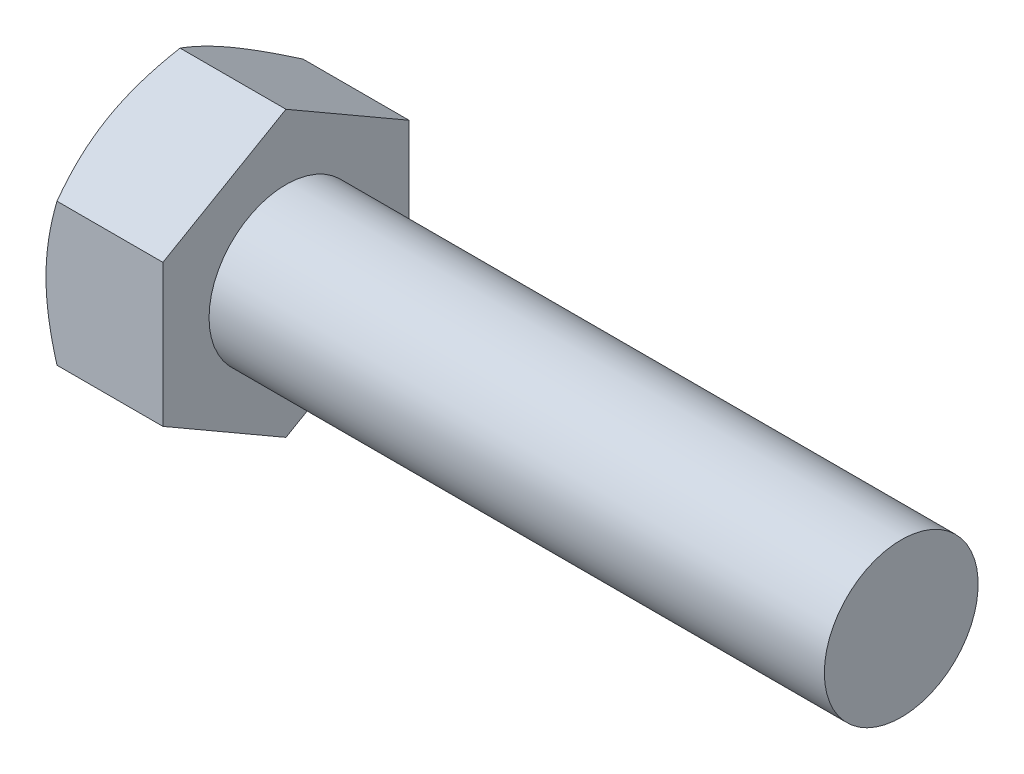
ISO-10303-21;
HEADER;
FILE_DESCRIPTION(('STEP AP214'),'2;1');
FILE_NAME('part.step','',(''),(''),'','','');
FILE_SCHEMA(('AUTOMOTIVE_DESIGN { 1 0 10303 214 1 1 1 1 }'));
ENDSEC;
DATA;
#1=APPLICATION_CONTEXT('core data for automotive mechanical design processes');
#2=APPLICATION_PROTOCOL_DEFINITION('international standard','automotive_design',2000,#1);
#3=PRODUCT_CONTEXT('',#1,'mechanical');
#4=PRODUCT('Part','Part','',(#3));
#5=PRODUCT_RELATED_PRODUCT_CATEGORY('part','',(#4));
#6=PRODUCT_DEFINITION_FORMATION('','',#4);
#7=PRODUCT_DEFINITION_CONTEXT('part definition',#1,'design');
#8=PRODUCT_DEFINITION('design','',#6,#7);
#9=PRODUCT_DEFINITION_SHAPE('','',#8);
#10=(LENGTH_UNIT() NAMED_UNIT(*) SI_UNIT(.MILLI.,.METRE.));
#11=(NAMED_UNIT(*) PLANE_ANGLE_UNIT() SI_UNIT($,.RADIAN.));
#12=(NAMED_UNIT(*) SI_UNIT($,.STERADIAN.) SOLID_ANGLE_UNIT());
#13=UNCERTAINTY_MEASURE_WITH_UNIT(LENGTH_MEASURE(1.E-05),#10,'distance_accuracy_value','');
#14=(GEOMETRIC_REPRESENTATION_CONTEXT(3) GLOBAL_UNCERTAINTY_ASSIGNED_CONTEXT((#13)) GLOBAL_UNIT_ASSIGNED_CONTEXT((#10,
#11,#12)) REPRESENTATION_CONTEXT('',''));
#15=CARTESIAN_POINT('',(0.,0.,0.));
#16=DIRECTION('',(0.,0.,1.));
#17=DIRECTION('',(1.,0.,0.));
#18=AXIS2_PLACEMENT_3D('',#15,#16,#17);
#19=CARTESIAN_POINT('',(3.8,2.5,0.));
#20=DIRECTION('',(-1.,0.,0.));
#21=DIRECTION('',(0.,0.,1.));
#22=AXIS2_PLACEMENT_3D('',#19,#20,#21);
#23=PLANE('',#22);
#24=CARTESIAN_POINT('',(3.8,0.,0.));
#25=DIRECTION('',(-1.,0.,0.));
#26=DIRECTION('',(0.,0.,1.));
#27=AXIS2_PLACEMENT_3D('',#24,#25,#26);
#28=CIRCLE('',#27,2.5);
#29=CARTESIAN_POINT('',(3.8,0.,2.5));
#30=VERTEX_POINT('',#29);
#31=EDGE_CURVE('E204',#30,#30,#28,.T.);
#32=ORIENTED_EDGE('',*,*,#31,.T.);
#33=EDGE_LOOP('',(#32));
#34=FACE_BOUND('',#33,.T.);
#35=DIRECTION('',(0.,1.,0.));
#36=VECTOR('',#35,1.);
#37=CARTESIAN_POINT('',(3.8,-2.30940108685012,4.));
#38=LINE('',#37,#36);
#39=CARTESIAN_POINT('',(3.8,-2.30940108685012,4.));
#40=VERTEX_POINT('',#39);
#41=CARTESIAN_POINT('',(3.8,2.30940108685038,4.));
#42=VERTEX_POINT('',#41);
#43=EDGE_CURVE('E64',#40,#42,#38,.T.);
#44=ORIENTED_EDGE('',*,*,#43,.F.);
#45=DIRECTION('',(0.,0.500000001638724,0.866025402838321));
#46=VECTOR('',#45,1.);
#47=CARTESIAN_POINT('',(3.8,-4.61880217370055,0.));
#48=LINE('',#47,#46);
#49=CARTESIAN_POINT('',(3.8,-4.61880217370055,0.));
#50=VERTEX_POINT('',#49);
#51=EDGE_CURVE('E137',#50,#40,#48,.T.);
#52=ORIENTED_EDGE('',*,*,#51,.F.);
#53=DIRECTION('',(0.,-0.500000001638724,0.866025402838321));
#54=VECTOR('',#53,1.);
#55=CARTESIAN_POINT('',(3.8,-2.30940108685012,-4.));
#56=LINE('',#55,#54);
#57=CARTESIAN_POINT('',(3.8,-2.30940108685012,-4.));
#58=VERTEX_POINT('',#57);
#59=EDGE_CURVE('E135',#58,#50,#56,.T.);
#60=ORIENTED_EDGE('',*,*,#59,.F.);
#61=DIRECTION('',(0.,-1.,0.));
#62=VECTOR('',#61,1.);
#63=CARTESIAN_POINT('',(3.8,2.30940108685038,-4.));
#64=LINE('',#63,#62);
#65=CARTESIAN_POINT('',(3.8,2.30940108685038,-4.));
#66=VERTEX_POINT('',#65);
#67=EDGE_CURVE('E118',#66,#58,#64,.T.);
#68=ORIENTED_EDGE('',*,*,#67,.F.);
#69=DIRECTION('',(0.,-0.500000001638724,-0.866025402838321));
#70=VECTOR('',#69,1.);
#71=CARTESIAN_POINT('',(3.8,4.61880217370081,0.));
#72=LINE('',#71,#70);
#73=CARTESIAN_POINT('',(3.8,4.61880217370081,0.));
#74=VERTEX_POINT('',#73);
#75=EDGE_CURVE('E127',#74,#66,#72,.T.);
#76=ORIENTED_EDGE('',*,*,#75,.F.);
#77=DIRECTION('',(0.,0.500000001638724,-0.866025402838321));
#78=VECTOR('',#77,1.);
#79=CARTESIAN_POINT('',(3.8,2.30940108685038,4.));
#80=LINE('',#79,#78);
#81=EDGE_CURVE('E131',#42,#74,#80,.T.);
#82=ORIENTED_EDGE('',*,*,#81,.F.);
#83=EDGE_LOOP('',(#44,#52,#60,#68,#76,#82));
#84=FACE_BOUND('',#83,.T.);
#85=ADVANCED_FACE('F41',(#34,#84),#23,.F.);
#86=CARTESIAN_POINT('',(-25.4,0.,0.));
#87=DIRECTION('',(-1.,0.,0.));
#88=DIRECTION('',(0.,0.,1.));
#89=AXIS2_PLACEMENT_3D('',#86,#87,#88);
#90=CYLINDRICAL_SURFACE('',#89,2.5);
#91=CARTESIAN_POINT('',(23.8,0.,0.));
#92=DIRECTION('',(-1.,0.,0.));
#93=DIRECTION('',(0.,0.,1.));
#94=AXIS2_PLACEMENT_3D('',#91,#92,#93);
#95=CIRCLE('',#94,2.5);
#96=CARTESIAN_POINT('',(23.8,0.,2.5));
#97=VERTEX_POINT('',#96);
#98=EDGE_CURVE('E11',#97,#97,#95,.T.);
#99=ORIENTED_EDGE('',*,*,#98,.T.);
#100=EDGE_LOOP('',(#99));
#101=FACE_BOUND('',#100,.T.);
#102=ORIENTED_EDGE('',*,*,#31,.F.);
#103=EDGE_LOOP('',(#102));
#104=FACE_BOUND('',#103,.T.);
#105=ADVANCED_FACE('F43',(#101,#104),#90,.T.);
#106=CARTESIAN_POINT('',(23.8,2.5,0.));
#107=DIRECTION('',(1.,0.,0.));
#108=DIRECTION('',(0.,0.,-1.));
#109=AXIS2_PLACEMENT_3D('',#106,#107,#108);
#110=PLANE('',#109);
#111=ORIENTED_EDGE('',*,*,#98,.F.);
#112=EDGE_LOOP('',(#111));
#113=FACE_BOUND('',#112,.T.);
#114=ADVANCED_FACE('F185',(#113),#110,.T.);
#115=CARTESIAN_POINT('',(3.8,-2.30940108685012,4.));
#116=DIRECTION('',(0.,0.,1.));
#117=DIRECTION('',(1.,0.,0.));
#118=AXIS2_PLACEMENT_3D('',#115,#116,#117);
#119=PLANE('',#118);
#120=DIRECTION('',(-1.,0.,0.));
#121=VECTOR('',#120,1.);
#122=CARTESIAN_POINT('',(3.8,-2.30940108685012,4.));
#123=LINE('',#122,#121);
#124=CARTESIAN_POINT('',(0.357265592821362,-2.30940108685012,4.));
#125=VERTEX_POINT('',#124);
#126=EDGE_CURVE('E144',#40,#125,#123,.T.);
#127=ORIENTED_EDGE('',*,*,#126,.F.);
#128=ORIENTED_EDGE('',*,*,#43,.T.);
#129=DIRECTION('',(-1.,0.,0.));
#130=VECTOR('',#129,1.);
#131=CARTESIAN_POINT('',(3.8,2.30940108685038,4.));
#132=LINE('',#131,#130);
#133=CARTESIAN_POINT('',(0.357265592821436,2.30940108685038,4.));
#134=VERTEX_POINT('',#133);
#135=EDGE_CURVE('E143',#42,#134,#132,.T.);
#136=ORIENTED_EDGE('',*,*,#135,.T.);
#137=CARTESIAN_POINT('',(1.91411207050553,-6.1248828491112,4.));
#138=CARTESIAN_POINT('',(1.82924143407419,-5.94926014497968,4.));
#139=CARTESIAN_POINT('',(1.74521447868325,-5.7732222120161,4.));
#140=CARTESIAN_POINT('',(1.57933003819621,-5.42009137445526,4.));
#141=CARTESIAN_POINT('',(1.49747292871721,-5.24299829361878,4.));
#142=CARTESIAN_POINT('',(1.33597906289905,-4.8865760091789,4.));
#143=CARTESIAN_POINT('',(1.25635769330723,-4.70723980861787,4.));
#144=CARTESIAN_POINT('',(1.10053486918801,-4.34709342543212,4.));
#145=CARTESIAN_POINT('',(1.02433323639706,-4.16628332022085,4.));
#146=CARTESIAN_POINT('',(0.875354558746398,-3.80065688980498,4.));
#147=CARTESIAN_POINT('',(0.802631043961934,-3.61581863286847,4.));
#148=CARTESIAN_POINT('',(0.662879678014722,-3.24396193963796,4.));
#149=CARTESIAN_POINT('',(0.595852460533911,-3.056943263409,4.));
#150=CARTESIAN_POINT('',(0.469294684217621,-2.680812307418,4.));
#151=CARTESIAN_POINT('',(0.409748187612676,-2.49170544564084,4.));
#152=CARTESIAN_POINT('',(0.300085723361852,-2.11080331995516,4.));
#153=CARTESIAN_POINT('',(0.249966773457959,-1.91900892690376,4.));
#154=CARTESIAN_POINT('',(0.161592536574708,-1.53260074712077,4.));
#155=CARTESIAN_POINT('',(0.12334040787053,-1.33798622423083,4.));
#156=CARTESIAN_POINT('',(0.0612753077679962,-0.9464107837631,4.));
#157=CARTESIAN_POINT('',(0.0374623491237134,-0.749449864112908,4.));
#158=CARTESIAN_POINT('',(0.00638220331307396,-0.35545965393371,4.));
#159=CARTESIAN_POINT('',(-0.000989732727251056,-0.158438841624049,4.));
#160=CARTESIAN_POINT('',(0.00120381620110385,0.235464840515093,4.));
#161=CARTESIAN_POINT('',(0.0107649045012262,0.432347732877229,4.));
#162=CARTESIAN_POINT('',(0.0408779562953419,0.768553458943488,4.));
#163=CARTESIAN_POINT('',(0.0575083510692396,0.908247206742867,4.));
#164=CARTESIAN_POINT('',(0.0982121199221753,1.18655561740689,4.));
#165=CARTESIAN_POINT('',(0.122286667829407,1.32517010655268,4.));
#166=CARTESIAN_POINT('',(0.204413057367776,1.73928168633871,4.));
#167=CARTESIAN_POINT('',(0.272346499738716,2.01283770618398,4.));
#168=CARTESIAN_POINT('',(0.389513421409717,2.42217270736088,4.));
#169=CARTESIAN_POINT('',(0.431710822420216,2.56008534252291,4.));
#170=CARTESIAN_POINT('',(0.520281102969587,2.8344711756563,4.));
#171=CARTESIAN_POINT('',(0.5666511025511,2.97094529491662,4.));
#172=CARTESIAN_POINT('',(0.66260169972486,3.2418834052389,4.));
#173=CARTESIAN_POINT('',(0.712162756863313,3.37635438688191,4.));
#174=CARTESIAN_POINT('',(0.814193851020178,3.64425303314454,4.));
#175=CARTESIAN_POINT('',(0.866665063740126,3.77768025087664,4.));
#176=CARTESIAN_POINT('',(0.920304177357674,3.91062502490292,4.));
#177=B_SPLINE_CURVE_WITH_KNOTS('',3,(#137,#138,#139,#140,#141,#142,#143,#144,#145,#146,#147,
#148,#149,#150,#151,#152,#153,#154,#155,#156,#157,#158,#159,#160,#161,#162,#163,#164,#165,#166,
#167,#168,#169,#170,#171,#172,#173,#174,#175,#176),.UNSPECIFIED.,.F.,.F.,(4,2,2,2,2,2,2,2,2,2,2,
2,2,2,2,2,2,2,2,4),(0.,0.585172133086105,1.17044491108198,1.75906694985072,2.34765826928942,
2.94347582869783,3.53935958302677,4.13395145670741,4.72835492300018,5.3229164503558,
5.91747850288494,6.50824153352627,7.09885119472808,7.52068574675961,7.94258684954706,
8.7870169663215,9.21965414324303,9.65199496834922,10.0819022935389,10.5119845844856),.UNSPECIFIED.);
#178=CARTESIAN_POINT('',(0.,0.,4.));
#179=VERTEX_POINT('',#178);
#180=EDGE_CURVE('E187',#179,#134,#177,.T.);
#181=ORIENTED_EDGE('',*,*,#180,.F.);
#182=EDGE_CURVE('E195',#125,#179,#177,.T.);
#183=ORIENTED_EDGE('',*,*,#182,.F.);
#184=EDGE_LOOP('',(#127,#128,#136,#181,#183));
#185=FACE_BOUND('',#184,.T.);
#186=ADVANCED_FACE('F181',(#185),#119,.T.);
#187=CARTESIAN_POINT('',(3.8,-4.61880217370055,0.));
#188=DIRECTION('',(0.,-0.866025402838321,0.500000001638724));
#189=DIRECTION('',(0.,-0.500000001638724,-0.866025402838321));
#190=AXIS2_PLACEMENT_3D('',#187,#188,#189);
#191=PLANE('',#190);
#192=DIRECTION('',(-1.,0.,0.));
#193=VECTOR('',#192,1.);
#194=CARTESIAN_POINT('',(3.8,-4.61880217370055,0.));
#195=LINE('',#194,#193);
#196=CARTESIAN_POINT('',(0.357265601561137,-4.61880217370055,0.));
#197=VERTEX_POINT('',#196);
#198=EDGE_CURVE('E148',#50,#197,#195,.T.);
#199=ORIENTED_EDGE('',*,*,#198,.F.);
#200=ORIENTED_EDGE('',*,*,#51,.T.);
#201=ORIENTED_EDGE('',*,*,#126,.T.);
#202=CARTESIAN_POINT('',(0.357332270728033,-4.61891764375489,-0.000200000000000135));
#203=CARTESIAN_POINT('',(0.298717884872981,-4.51743150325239,0.175579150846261));
#204=CARTESIAN_POINT('',(0.245410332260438,-4.41506934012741,0.352875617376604));
#205=CARTESIAN_POINT('',(0.152361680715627,-4.20857252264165,0.710538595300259));
#206=CARTESIAN_POINT('',(0.112653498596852,-4.1044341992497,0.890911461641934));
#207=CARTESIAN_POINT('',(0.0508422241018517,-3.89744814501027,1.24942182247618));
#208=CARTESIAN_POINT('',(0.0283277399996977,-3.79463226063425,1.42750415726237));
#209=CARTESIAN_POINT('',(0.00145063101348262,-3.58851673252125,1.78450672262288));
#210=CARTESIAN_POINT('',(-0.0029342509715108,-3.48521783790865,1.96342565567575));
#211=CARTESIAN_POINT('',(0.00619008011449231,-3.29219971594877,2.29774284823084));
#212=CARTESIAN_POINT('',(0.0174589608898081,-3.2024515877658,2.45319116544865));
#213=CARTESIAN_POINT('',(0.0531739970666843,-3.02354003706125,2.76307505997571));
#214=CARTESIAN_POINT('',(0.077632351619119,-2.93437723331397,2.91750956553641));
#215=CARTESIAN_POINT('',(0.138776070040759,-2.75509683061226,3.22803233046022));
#216=CARTESIAN_POINT('',(0.175720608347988,-2.66500192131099,3.38408129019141));
#217=CARTESIAN_POINT('',(0.25957007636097,-2.48615581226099,3.69385183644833));
#218=CARTESIAN_POINT('',(0.306455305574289,-2.39740232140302,3.84757739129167));
#219=CARTESIAN_POINT('',(0.357332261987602,-2.30928561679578,4.0002));
#220=B_SPLINE_CURVE_WITH_KNOTS('',3,(#202,#203,#204,#205,#206,#207,#208,#209,#210,#211,#212,
#213,#214,#215,#216,#217,#218,#219),.UNSPECIFIED.,.F.,.F.,(4,2,2,2,2,2,2,2,4),(0.,
0.634047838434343,1.26961969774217,1.88946158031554,2.5085422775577,3.04757826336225,
3.58711366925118,4.13861653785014,4.68903648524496),.UNSPECIFIED.);
#221=CARTESIAN_POINT('',(0.,-3.46410162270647,2.00000001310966));
#222=VERTEX_POINT('',#221);
#223=EDGE_CURVE('E197',#222,#125,#220,.T.);
#224=ORIENTED_EDGE('',*,*,#223,.F.);
#225=EDGE_CURVE('E196',#197,#222,#220,.T.);
#226=ORIENTED_EDGE('',*,*,#225,.F.);
#227=EDGE_LOOP('',(#199,#200,#201,#224,#226));
#228=FACE_BOUND('',#227,.T.);
#229=ADVANCED_FACE('F184',(#228),#191,.T.);
#230=CARTESIAN_POINT('',(3.8,-2.30940108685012,-4.));
#231=DIRECTION('',(0.,-0.866025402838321,-0.500000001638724));
#232=DIRECTION('',(0.,0.500000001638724,-0.866025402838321));
#233=AXIS2_PLACEMENT_3D('',#230,#231,#232);
#234=PLANE('',#233);
#235=DIRECTION('',(-1.,0.,0.));
#236=VECTOR('',#235,1.);
#237=CARTESIAN_POINT('',(3.8,-2.30940108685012,-4.));
#238=LINE('',#237,#236);
#239=CARTESIAN_POINT('',(0.357265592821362,-2.30940108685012,-4.));
#240=VERTEX_POINT('',#239);
#241=EDGE_CURVE('E124',#58,#240,#238,.T.);
#242=ORIENTED_EDGE('',*,*,#241,.F.);
#243=ORIENTED_EDGE('',*,*,#59,.T.);
#244=ORIENTED_EDGE('',*,*,#198,.T.);
#245=CARTESIAN_POINT('',(0.357332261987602,-2.30928561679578,-4.0002));
#246=CARTESIAN_POINT('',(0.29871787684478,-2.41077175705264,-3.8244208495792));
#247=CARTESIAN_POINT('',(0.245410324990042,-2.51313391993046,-3.64712438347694));
#248=CARTESIAN_POINT('',(0.152361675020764,-2.7196307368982,-3.28946140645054));
#249=CARTESIAN_POINT('',(0.112653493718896,-2.82376906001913,-3.10908854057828));
#250=CARTESIAN_POINT('',(0.0508422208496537,-3.03075511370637,-2.75057818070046));
#251=CARTESIAN_POINT('',(0.0283277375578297,-3.13357099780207,-2.5724958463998));
#252=CARTESIAN_POINT('',(0.00145063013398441,-3.3396865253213,-2.21549328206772));
#253=CARTESIAN_POINT('',(-0.00293425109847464,-3.44298541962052,-2.03657434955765));
#254=CARTESIAN_POINT('',(0.0061900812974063,-3.6360035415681,-1.70225715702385));
#255=CARTESIAN_POINT('',(0.0174589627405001,-3.72575167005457,-1.54680883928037));
#256=CARTESIAN_POINT('',(0.053174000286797,-3.90466322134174,-1.23692494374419));
#257=CARTESIAN_POINT('',(0.0776323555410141,-3.9938260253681,-1.08249043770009));
#258=CARTESIAN_POINT('',(0.138776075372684,-4.17310642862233,-0.771967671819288));
#259=CARTESIAN_POINT('',(0.175720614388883,-4.26320133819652,-0.615918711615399));
#260=CARTESIAN_POINT('',(0.259570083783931,-4.44204744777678,-0.30614816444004));
#261=CARTESIAN_POINT('',(0.306455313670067,-4.53080093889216,-0.152422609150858));
#262=CARTESIAN_POINT('',(0.357332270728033,-4.61891764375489,0.000200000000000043));
#263=B_SPLINE_CURVE_WITH_KNOTS('',3,(#245,#246,#247,#248,#249,#250,#251,#252,#253,#254,#255,
#256,#257,#258,#259,#260,#261,#262),.UNSPECIFIED.,.F.,.F.,(4,2,2,2,2,2,2,2,4),(0.,
0.634047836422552,1.26961969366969,1.88946157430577,2.50854226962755,3.04757825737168,
3.58711366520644,4.13861653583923,4.68903648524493),.UNSPECIFIED.);
#264=CARTESIAN_POINT('',(0.,-3.46410162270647,-2.00000001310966));
#265=VERTEX_POINT('',#264);
#266=EDGE_CURVE('E227',#265,#197,#263,.T.);
#267=ORIENTED_EDGE('',*,*,#266,.F.);
#268=EDGE_CURVE('E232',#240,#265,#263,.T.);
#269=ORIENTED_EDGE('',*,*,#268,.F.);
#270=EDGE_LOOP('',(#242,#243,#244,#267,#269));
#271=FACE_BOUND('',#270,.T.);
#272=ADVANCED_FACE('F303',(#271),#234,.T.);
#273=CARTESIAN_POINT('',(3.8,2.30940108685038,-4.));
#274=DIRECTION('',(0.,0.,-1.));
#275=DIRECTION('',(-1.,0.,0.));
#276=AXIS2_PLACEMENT_3D('',#273,#274,#275);
#277=PLANE('',#276);
#278=DIRECTION('',(-1.,0.,0.));
#279=VECTOR('',#278,1.);
#280=CARTESIAN_POINT('',(3.8,2.30940108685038,-4.));
#281=LINE('',#280,#279);
#282=CARTESIAN_POINT('',(0.357265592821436,2.30940108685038,-4.));
#283=VERTEX_POINT('',#282);
#284=EDGE_CURVE('E113',#66,#283,#281,.T.);
#285=ORIENTED_EDGE('',*,*,#284,.F.);
#286=ORIENTED_EDGE('',*,*,#67,.T.);
#287=ORIENTED_EDGE('',*,*,#241,.T.);
#288=CARTESIAN_POINT('',(1.91411207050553,-6.1248828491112,-4.));
#289=CARTESIAN_POINT('',(1.82924143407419,-5.94926014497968,-4.));
#290=CARTESIAN_POINT('',(1.74521447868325,-5.7732222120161,-4.));
#291=CARTESIAN_POINT('',(1.57933003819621,-5.42009137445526,-4.));
#292=CARTESIAN_POINT('',(1.49747292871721,-5.24299829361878,-4.));
#293=CARTESIAN_POINT('',(1.33597906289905,-4.8865760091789,-4.));
#294=CARTESIAN_POINT('',(1.25635769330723,-4.70723980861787,-4.));
#295=CARTESIAN_POINT('',(1.10053486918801,-4.34709342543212,-4.));
#296=CARTESIAN_POINT('',(1.02433323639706,-4.16628332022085,-4.));
#297=CARTESIAN_POINT('',(0.875354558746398,-3.80065688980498,-4.));
#298=CARTESIAN_POINT('',(0.802631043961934,-3.61581863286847,-4.));
#299=CARTESIAN_POINT('',(0.662879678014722,-3.24396193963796,-4.));
#300=CARTESIAN_POINT('',(0.595852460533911,-3.056943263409,-4.));
#301=CARTESIAN_POINT('',(0.469294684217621,-2.680812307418,-4.));
#302=CARTESIAN_POINT('',(0.409748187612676,-2.49170544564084,-4.));
#303=CARTESIAN_POINT('',(0.300085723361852,-2.11080331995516,-4.));
#304=CARTESIAN_POINT('',(0.249966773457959,-1.91900892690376,-4.));
#305=CARTESIAN_POINT('',(0.161592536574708,-1.53260074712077,-4.));
#306=CARTESIAN_POINT('',(0.12334040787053,-1.33798622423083,-4.));
#307=CARTESIAN_POINT('',(0.0612753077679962,-0.9464107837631,-4.));
#308=CARTESIAN_POINT('',(0.0374623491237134,-0.749449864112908,-4.));
#309=CARTESIAN_POINT('',(0.00638220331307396,-0.35545965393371,-4.));
#310=CARTESIAN_POINT('',(-0.000989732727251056,-0.158438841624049,-4.));
#311=CARTESIAN_POINT('',(0.00120381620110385,0.235464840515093,-4.));
#312=CARTESIAN_POINT('',(0.0107649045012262,0.432347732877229,-4.));
#313=CARTESIAN_POINT('',(0.0408779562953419,0.768553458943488,-4.));
#314=CARTESIAN_POINT('',(0.0575083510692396,0.908247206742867,-4.));
#315=CARTESIAN_POINT('',(0.0982121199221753,1.18655561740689,-4.));
#316=CARTESIAN_POINT('',(0.122286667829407,1.32517010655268,-4.));
#317=CARTESIAN_POINT('',(0.204413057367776,1.73928168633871,-4.));
#318=CARTESIAN_POINT('',(0.272346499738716,2.01283770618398,-4.));
#319=CARTESIAN_POINT('',(0.389513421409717,2.42217270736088,-4.));
#320=CARTESIAN_POINT('',(0.431710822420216,2.56008534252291,-4.));
#321=CARTESIAN_POINT('',(0.520281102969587,2.8344711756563,-4.));
#322=CARTESIAN_POINT('',(0.5666511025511,2.97094529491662,-4.));
#323=CARTESIAN_POINT('',(0.66260169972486,3.2418834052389,-4.));
#324=CARTESIAN_POINT('',(0.712162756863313,3.37635438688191,-4.));
#325=CARTESIAN_POINT('',(0.814193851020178,3.64425303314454,-4.));
#326=CARTESIAN_POINT('',(0.866665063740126,3.77768025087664,-4.));
#327=CARTESIAN_POINT('',(0.920304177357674,3.91062502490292,-4.));
#328=B_SPLINE_CURVE_WITH_KNOTS('',3,(#288,#289,#290,#291,#292,#293,#294,#295,#296,#297,#298,
#299,#300,#301,#302,#303,#304,#305,#306,#307,#308,#309,#310,#311,#312,#313,#314,#315,#316,#317,
#318,#319,#320,#321,#322,#323,#324,#325,#326,#327),.UNSPECIFIED.,.F.,.F.,(4,2,2,2,2,2,2,2,2,2,2,
2,2,2,2,2,2,2,2,4),(0.,0.585172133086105,1.17044491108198,1.75906694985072,2.34765826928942,
2.94347582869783,3.53935958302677,4.13395145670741,4.72835492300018,5.3229164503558,
5.91747850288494,6.50824153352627,7.09885119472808,7.52068574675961,7.94258684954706,
8.7870169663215,9.21965414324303,9.65199496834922,10.0819022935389,10.5119845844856),.UNSPECIFIED.);
#329=CARTESIAN_POINT('',(0.,0.,-4.));
#330=VERTEX_POINT('',#329);
#331=EDGE_CURVE('E228',#330,#240,#328,.F.);
#332=ORIENTED_EDGE('',*,*,#331,.F.);
#333=EDGE_CURVE('E121',#283,#330,#328,.F.);
#334=ORIENTED_EDGE('',*,*,#333,.F.);
#335=EDGE_LOOP('',(#285,#286,#287,#332,#334));
#336=FACE_BOUND('',#335,.T.);
#337=ADVANCED_FACE('F115',(#336),#277,.T.);
#338=CARTESIAN_POINT('',(3.8,4.61880217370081,0.));
#339=DIRECTION('',(0.,0.866025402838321,-0.500000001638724));
#340=DIRECTION('',(0.,0.500000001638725,0.866025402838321));
#341=AXIS2_PLACEMENT_3D('',#338,#339,#340);
#342=PLANE('',#341);
#343=DIRECTION('',(-1.,0.,0.));
#344=VECTOR('',#343,1.);
#345=CARTESIAN_POINT('',(3.8,4.61880217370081,0.));
#346=LINE('',#345,#344);
#347=CARTESIAN_POINT('',(0.357265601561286,4.61880217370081,0.));
#348=VERTEX_POINT('',#347);
#349=EDGE_CURVE('E56',#74,#348,#346,.T.);
#350=ORIENTED_EDGE('',*,*,#349,.F.);
#351=ORIENTED_EDGE('',*,*,#75,.T.);
#352=ORIENTED_EDGE('',*,*,#284,.T.);
#353=CARTESIAN_POINT('',(0.357332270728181,4.61891764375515,0.000200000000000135));
#354=CARTESIAN_POINT('',(0.298717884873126,4.51743150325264,-0.175579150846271));
#355=CARTESIAN_POINT('',(0.24541033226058,4.41506934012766,-0.352875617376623));
#356=CARTESIAN_POINT('',(0.152361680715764,4.20857252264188,-0.710538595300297));
#357=CARTESIAN_POINT('',(0.112653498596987,4.10443419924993,-0.890911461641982));
#358=CARTESIAN_POINT('',(0.0508422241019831,3.89744814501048,-1.24942182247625));
#359=CARTESIAN_POINT('',(0.0283277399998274,3.79463226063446,-1.42750415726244));
#360=CARTESIAN_POINT('',(0.00145063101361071,3.58851673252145,-1.78450672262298));
#361=CARTESIAN_POINT('',(-0.00293425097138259,3.48521783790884,-1.96342565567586));
#362=CARTESIAN_POINT('',(0.0061900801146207,3.29219971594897,-2.29774284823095));
#363=CARTESIAN_POINT('',(0.0174589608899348,3.202451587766,-2.45319116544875));
#364=CARTESIAN_POINT('',(0.0531739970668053,3.02354003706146,-2.76307505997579));
#365=CARTESIAN_POINT('',(0.0776323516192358,2.93437723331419,-2.91750956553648));
#366=CARTESIAN_POINT('',(0.138776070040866,2.75509683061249,-3.22803233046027));
#367=CARTESIAN_POINT('',(0.175720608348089,2.66500192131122,-3.38408129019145));
#368=CARTESIAN_POINT('',(0.259570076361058,2.48615581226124,-3.69385183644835));
#369=CARTESIAN_POINT('',(0.306455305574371,2.39740232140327,-3.84757739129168));
#370=CARTESIAN_POINT('',(0.357332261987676,2.30928561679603,-4.0002));
#371=B_SPLINE_CURVE_WITH_KNOTS('',3,(#353,#354,#355,#356,#357,#358,#359,#360,#361,#362,#363,
#364,#365,#366,#367,#368,#369,#370),.UNSPECIFIED.,.F.,.F.,(4,2,2,2,2,2,2,2,4),(0.,
0.634047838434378,1.26961969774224,1.88946158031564,2.50854227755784,3.04757826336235,
3.58711366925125,4.13861653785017,4.68903648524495),.UNSPECIFIED.);
#372=CARTESIAN_POINT('',(0.,3.46410162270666,-2.00000001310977));
#373=VERTEX_POINT('',#372);
#374=EDGE_CURVE('E163',#373,#283,#371,.T.);
#375=ORIENTED_EDGE('',*,*,#374,.F.);
#376=EDGE_CURVE('E291',#348,#373,#371,.T.);
#377=ORIENTED_EDGE('',*,*,#376,.F.);
#378=EDGE_LOOP('',(#350,#351,#352,#375,#377));
#379=FACE_BOUND('',#378,.T.);
#380=ADVANCED_FACE('F128',(#379),#342,.T.);
#381=CARTESIAN_POINT('',(3.8,2.30940108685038,4.));
#382=DIRECTION('',(0.,0.866025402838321,0.500000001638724));
#383=DIRECTION('',(0.,-0.500000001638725,0.866025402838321));
#384=AXIS2_PLACEMENT_3D('',#381,#382,#383);
#385=PLANE('',#384);
#386=ORIENTED_EDGE('',*,*,#135,.F.);
#387=ORIENTED_EDGE('',*,*,#81,.T.);
#388=ORIENTED_EDGE('',*,*,#349,.T.);
#389=CARTESIAN_POINT('',(0.357332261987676,2.30928561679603,4.0002));
#390=CARTESIAN_POINT('',(0.298717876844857,2.4107717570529,3.82442084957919));
#391=CARTESIAN_POINT('',(0.245410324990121,2.51313391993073,3.64712438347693));
#392=CARTESIAN_POINT('',(0.152361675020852,2.71963073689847,3.28946140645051));
#393=CARTESIAN_POINT('',(0.11265349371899,2.8237690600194,3.10908854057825));
#394=CARTESIAN_POINT('',(0.0508422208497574,3.03075511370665,2.75057818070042));
#395=CARTESIAN_POINT('',(0.0283277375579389,3.13357099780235,2.57249584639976));
#396=CARTESIAN_POINT('',(0.00145063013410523,3.33968652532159,2.21549328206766));
#397=CARTESIAN_POINT('',(-0.00293425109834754,3.44298541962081,2.03657434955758));
#398=CARTESIAN_POINT('',(0.00619008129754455,3.63600354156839,1.70225715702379));
#399=CARTESIAN_POINT('',(0.0174589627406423,3.72575167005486,1.54680883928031));
#400=CARTESIAN_POINT('',(0.0531740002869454,3.90466322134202,1.23692494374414));
#401=CARTESIAN_POINT('',(0.0776323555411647,3.99382602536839,1.08249043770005));
#402=CARTESIAN_POINT('',(0.138776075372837,4.17310642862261,0.771967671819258));
#403=CARTESIAN_POINT('',(0.175720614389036,4.26320133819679,0.615918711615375));
#404=CARTESIAN_POINT('',(0.259570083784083,4.44204744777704,0.306148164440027));
#405=CARTESIAN_POINT('',(0.306455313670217,4.53080093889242,0.152422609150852));
#406=CARTESIAN_POINT('',(0.357332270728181,4.61891764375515,-0.000200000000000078));
#407=B_SPLINE_CURVE_WITH_KNOTS('',3,(#389,#390,#391,#392,#393,#394,#395,#396,#397,#398,#399,
#400,#401,#402,#403,#404,#405,#406),.UNSPECIFIED.,.F.,.F.,(4,2,2,2,2,2,2,2,4),(0.,
0.63404783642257,1.26961969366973,1.88946157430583,2.50854226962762,3.04757825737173,
3.58711366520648,4.13861653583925,4.68903648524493),.UNSPECIFIED.);
#408=CARTESIAN_POINT('',(0.,3.46410162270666,2.00000001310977));
#409=VERTEX_POINT('',#408);
#410=EDGE_CURVE('E147',#409,#348,#407,.T.);
#411=ORIENTED_EDGE('',*,*,#410,.F.);
#412=EDGE_CURVE('E162',#134,#409,#407,.T.);
#413=ORIENTED_EDGE('',*,*,#412,.F.);
#414=EDGE_LOOP('',(#386,#387,#388,#411,#413));
#415=FACE_BOUND('',#414,.T.);
#416=ADVANCED_FACE('F174',(#415),#385,.T.);
#417=CARTESIAN_POINT('',(0.,0.,0.));
#418=DIRECTION('',(1.,0.,0.));
#419=DIRECTION('',(0.,0.,-1.));
#420=AXIS2_PLACEMENT_3D('',#417,#418,#419);
#421=CONICAL_SURFACE('',#420,4.,1.0471975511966);
#422=CARTESIAN_POINT('',(0.,0.,0.));
#423=DIRECTION('',(-1.,0.,0.));
#424=DIRECTION('',(0.,0.,1.));
#425=AXIS2_PLACEMENT_3D('',#422,#423,#424);
#426=CIRCLE('',#425,4.);
#427=EDGE_CURVE('E206',#222,#179,#426,.T.);
#428=ORIENTED_EDGE('',*,*,#427,.F.);
#429=ORIENTED_EDGE('',*,*,#223,.T.);
#430=ORIENTED_EDGE('',*,*,#182,.T.);
#431=EDGE_LOOP('',(#428,#429,#430));
#432=FACE_BOUND('',#431,.T.);
#433=ADVANCED_FACE('F178',(#432),#421,.T.);
#434=EDGE_CURVE('E214',#265,#222,#426,.T.);
#435=ORIENTED_EDGE('',*,*,#434,.F.);
#436=ORIENTED_EDGE('',*,*,#266,.T.);
#437=ORIENTED_EDGE('',*,*,#225,.T.);
#438=EDGE_LOOP('',(#435,#436,#437));
#439=FACE_BOUND('',#438,.T.);
#440=ADVANCED_FACE('F237',(#439),#421,.T.);
#441=ORIENTED_EDGE('',*,*,#331,.T.);
#442=ORIENTED_EDGE('',*,*,#268,.T.);
#443=EDGE_CURVE('E217',#330,#265,#426,.T.);
#444=ORIENTED_EDGE('',*,*,#443,.F.);
#445=EDGE_LOOP('',(#441,#442,#444));
#446=FACE_BOUND('',#445,.T.);
#447=ADVANCED_FACE('F170',(#446),#421,.T.);
#448=ORIENTED_EDGE('',*,*,#374,.T.);
#449=ORIENTED_EDGE('',*,*,#333,.T.);
#450=EDGE_CURVE('E213',#373,#330,#426,.T.);
#451=ORIENTED_EDGE('',*,*,#450,.F.);
#452=EDGE_LOOP('',(#448,#449,#451));
#453=FACE_BOUND('',#452,.T.);
#454=ADVANCED_FACE('F226',(#453),#421,.T.);
#455=EDGE_CURVE('E49',#179,#409,#426,.T.);
#456=ORIENTED_EDGE('',*,*,#455,.F.);
#457=ORIENTED_EDGE('',*,*,#180,.T.);
#458=ORIENTED_EDGE('',*,*,#412,.T.);
#459=EDGE_LOOP('',(#456,#457,#458));
#460=FACE_BOUND('',#459,.T.);
#461=ADVANCED_FACE('F266',(#460),#421,.T.);
#462=CARTESIAN_POINT('',(0.,0.,0.));
#463=DIRECTION('',(-1.,0.,0.));
#464=DIRECTION('',(0.,0.,1.));
#465=AXIS2_PLACEMENT_3D('',#462,#463,#464);
#466=PLANE('',#465);
#467=CARTESIAN_POINT('',(0.,0.,0.));
#468=DIRECTION('',(1.,0.,0.));
#469=DIRECTION('',(0.,0.,-1.));
#470=AXIS2_PLACEMENT_3D('',#467,#468,#469);
#471=CIRCLE('',#470,3.5);
#472=CARTESIAN_POINT('',(0.,0.,3.5));
#473=VERTEX_POINT('',#472);
#474=EDGE_CURVE('E245',#473,#473,#471,.T.);
#475=ORIENTED_EDGE('',*,*,#474,.T.);
#476=EDGE_LOOP('',(#475));
#477=FACE_BOUND('',#476,.T.);
#478=ORIENTED_EDGE('',*,*,#455,.T.);
#479=EDGE_CURVE('E208',#409,#373,#426,.T.);
#480=ORIENTED_EDGE('',*,*,#479,.T.);
#481=ORIENTED_EDGE('',*,*,#450,.T.);
#482=ORIENTED_EDGE('',*,*,#443,.T.);
#483=ORIENTED_EDGE('',*,*,#434,.T.);
#484=ORIENTED_EDGE('',*,*,#427,.T.);
#485=EDGE_LOOP('',(#478,#480,#481,#482,#483,#484));
#486=FACE_BOUND('',#485,.T.);
#487=ADVANCED_FACE('F223',(#477,#486),#466,.T.);
#488=ORIENTED_EDGE('',*,*,#410,.T.);
#489=ORIENTED_EDGE('',*,*,#376,.T.);
#490=ORIENTED_EDGE('',*,*,#479,.F.);
#491=EDGE_LOOP('',(#488,#489,#490));
#492=FACE_BOUND('',#491,.T.);
#493=ADVANCED_FACE('F255',(#492),#421,.T.);
#494=CARTESIAN_POINT('',(0.475,0.,0.));
#495=DIRECTION('',(-1.,0.,0.));
#496=DIRECTION('',(0.,0.,1.));
#497=AXIS2_PLACEMENT_3D('',#494,#495,#496);
#498=CYLINDRICAL_SURFACE('',#497,3.5);
#499=CARTESIAN_POINT('',(0.475,0.,0.));
#500=DIRECTION('',(1.,0.,0.));
#501=DIRECTION('',(0.,0.,-1.));
#502=AXIS2_PLACEMENT_3D('',#499,#500,#501);
#503=CIRCLE('',#502,3.5);
#504=CARTESIAN_POINT('',(0.475,0.,3.5));
#505=VERTEX_POINT('',#504);
#506=EDGE_CURVE('E242',#505,#505,#503,.T.);
#507=CARTESIAN_POINT('',(0.475,0.,3.5));
#508=CARTESIAN_POINT('',(0.470052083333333,0.,3.5));
#509=CARTESIAN_POINT('',(0.465104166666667,0.,3.5));
#510=CARTESIAN_POINT('',(0.455208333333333,0.,3.5));
#511=CARTESIAN_POINT('',(0.450260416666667,0.,3.5));
#512=CARTESIAN_POINT('',(0.440364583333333,0.,3.5));
#513=CARTESIAN_POINT('',(0.435416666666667,0.,3.5));
#514=CARTESIAN_POINT('',(0.425520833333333,0.,3.5));
#515=CARTESIAN_POINT('',(0.420572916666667,0.,3.5));
#516=CARTESIAN_POINT('',(0.410677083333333,0.,3.5));
#517=CARTESIAN_POINT('',(0.405729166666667,0.,3.5));
#518=CARTESIAN_POINT('',(0.395833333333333,0.,3.5));
#519=CARTESIAN_POINT('',(0.390885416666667,0.,3.5));
#520=CARTESIAN_POINT('',(0.380989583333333,0.,3.5));
#521=CARTESIAN_POINT('',(0.376041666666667,0.,3.5));
#522=CARTESIAN_POINT('',(0.366145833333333,0.,3.5));
#523=CARTESIAN_POINT('',(0.361197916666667,0.,3.5));
#524=CARTESIAN_POINT('',(0.351302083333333,0.,3.5));
#525=CARTESIAN_POINT('',(0.346354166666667,0.,3.5));
#526=CARTESIAN_POINT('',(0.336458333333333,0.,3.5));
#527=CARTESIAN_POINT('',(0.331510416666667,0.,3.5));
#528=CARTESIAN_POINT('',(0.321614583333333,0.,3.5));
#529=CARTESIAN_POINT('',(0.316666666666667,0.,3.5));
#530=CARTESIAN_POINT('',(0.306770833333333,0.,3.5));
#531=CARTESIAN_POINT('',(0.301822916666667,0.,3.5));
#532=CARTESIAN_POINT('',(0.291927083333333,0.,3.5));
#533=CARTESIAN_POINT('',(0.286979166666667,0.,3.5));
#534=CARTESIAN_POINT('',(0.277083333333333,0.,3.5));
#535=CARTESIAN_POINT('',(0.272135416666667,0.,3.5));
#536=CARTESIAN_POINT('',(0.262239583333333,0.,3.5));
#537=CARTESIAN_POINT('',(0.257291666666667,0.,3.5));
#538=CARTESIAN_POINT('',(0.247395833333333,0.,3.5));
#539=CARTESIAN_POINT('',(0.242447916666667,0.,3.5));
#540=CARTESIAN_POINT('',(0.232552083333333,0.,3.5));
#541=CARTESIAN_POINT('',(0.227604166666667,0.,3.5));
#542=CARTESIAN_POINT('',(0.217708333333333,0.,3.5));
#543=CARTESIAN_POINT('',(0.212760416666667,0.,3.5));
#544=CARTESIAN_POINT('',(0.202864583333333,0.,3.5));
#545=CARTESIAN_POINT('',(0.197916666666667,0.,3.5));
#546=CARTESIAN_POINT('',(0.188020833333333,0.,3.5));
#547=CARTESIAN_POINT('',(0.183072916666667,0.,3.5));
#548=CARTESIAN_POINT('',(0.173177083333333,0.,3.5));
#549=CARTESIAN_POINT('',(0.168229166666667,0.,3.5));
#550=CARTESIAN_POINT('',(0.158333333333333,0.,3.5));
#551=CARTESIAN_POINT('',(0.153385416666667,0.,3.5));
#552=CARTESIAN_POINT('',(0.143489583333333,0.,3.5));
#553=CARTESIAN_POINT('',(0.138541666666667,0.,3.5));
#554=CARTESIAN_POINT('',(0.128645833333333,0.,3.5));
#555=CARTESIAN_POINT('',(0.123697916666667,0.,3.5));
#556=CARTESIAN_POINT('',(0.113802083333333,0.,3.5));
#557=CARTESIAN_POINT('',(0.108854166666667,0.,3.5));
#558=CARTESIAN_POINT('',(0.0989583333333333,0.,3.5));
#559=CARTESIAN_POINT('',(0.0940104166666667,0.,3.5));
#560=CARTESIAN_POINT('',(0.0841145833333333,0.,3.5));
#561=CARTESIAN_POINT('',(0.0791666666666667,0.,3.5));
#562=CARTESIAN_POINT('',(0.0692708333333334,0.,3.5));
#563=CARTESIAN_POINT('',(0.0643229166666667,0.,3.5));
#564=CARTESIAN_POINT('',(0.0544270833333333,0.,3.5));
#565=CARTESIAN_POINT('',(0.0494791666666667,0.,3.5));
#566=CARTESIAN_POINT('',(0.0395833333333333,0.,3.5));
#567=CARTESIAN_POINT('',(0.0346354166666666,0.,3.5));
#568=CARTESIAN_POINT('',(0.0247395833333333,0.,3.5));
#569=CARTESIAN_POINT('',(0.0197916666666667,0.,3.5));
#570=CARTESIAN_POINT('',(0.00989583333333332,0.,3.5));
#571=CARTESIAN_POINT('',(0.00494791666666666,0.,3.5));
#572=CARTESIAN_POINT('',(0.,0.,3.5));
#573=B_SPLINE_CURVE_WITH_KNOTS('',3,(#507,#508,#509,#510,#511,#512,#513,#514,#515,#516,#517,
#518,#519,#520,#521,#522,#523,#524,#525,#526,#527,#528,#529,#530,#531,#532,#533,#534,#535,#536,
#537,#538,#539,#540,#541,#542,#543,#544,#545,#546,#547,#548,#549,#550,#551,#552,#553,#554,#555,
#556,#557,#558,#559,#560,#561,#562,#563,#564,#565,#566,#567,#568,#569,#570,#571,#572),
.UNSPECIFIED.,.F.,.F.,(4,2,2,2,2,2,2,2,2,2,2,2,2,2,2,2,2,2,2,2,2,2,2,2,2,2,2,2,2,2,2,2,4),(0.,
0.01484375,0.0296875,0.04453125,0.059375,0.07421875,0.0890624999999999,0.10390625,0.11875,
0.13359375,0.1484375,0.16328125,0.178125,0.19296875,0.2078125,0.22265625,0.2375,0.25234375,
0.2671875,0.28203125,0.296875,0.31171875,0.3265625,0.34140625,0.35625,0.37109375,0.3859375,
0.40078125,0.415625,0.43046875,0.4453125,0.46015625,0.475),.UNSPECIFIED.);
#574=EDGE_CURVE('BSEAM252',#505,#473,#573,.T.);
#575=ORIENTED_EDGE('',*,*,#506,.T.);
#576=ORIENTED_EDGE('',*,*,#474,.F.);
#577=ORIENTED_EDGE('',*,*,#574,.T.);
#578=ORIENTED_EDGE('',*,*,#574,.F.);
#579=EDGE_LOOP('',(#575,#577,#576,#578));
#580=FACE_BOUND('',#579,.T.);
#581=ADVANCED_FACE('F252',(#580),#498,.F.);
#582=CARTESIAN_POINT('',(0.475,0.,0.));
#583=DIRECTION('',(1.,0.,0.));
#584=DIRECTION('',(0.,0.,-1.));
#585=AXIS2_PLACEMENT_3D('',#582,#583,#584);
#586=PLANE('',#585);
#587=ORIENTED_EDGE('',*,*,#506,.F.);
#588=EDGE_LOOP('',(#587));
#589=FACE_BOUND('',#588,.T.);
#590=ADVANCED_FACE('F254',(#589),#586,.F.);
#591=CLOSED_SHELL('',(#85,#105,#114,#186,#229,#272,#337,#380,#416,#433,#440,#447,#454,#461,#487,
#493,#581,#590));
#592=MANIFOLD_SOLID_BREP('B2',#591);
#593=ADVANCED_BREP_SHAPE_REPRESENTATION('',(#18,#592),#14);
#594=SHAPE_DEFINITION_REPRESENTATION(#9,#593);
ENDSEC;
END-ISO-10303-21;
